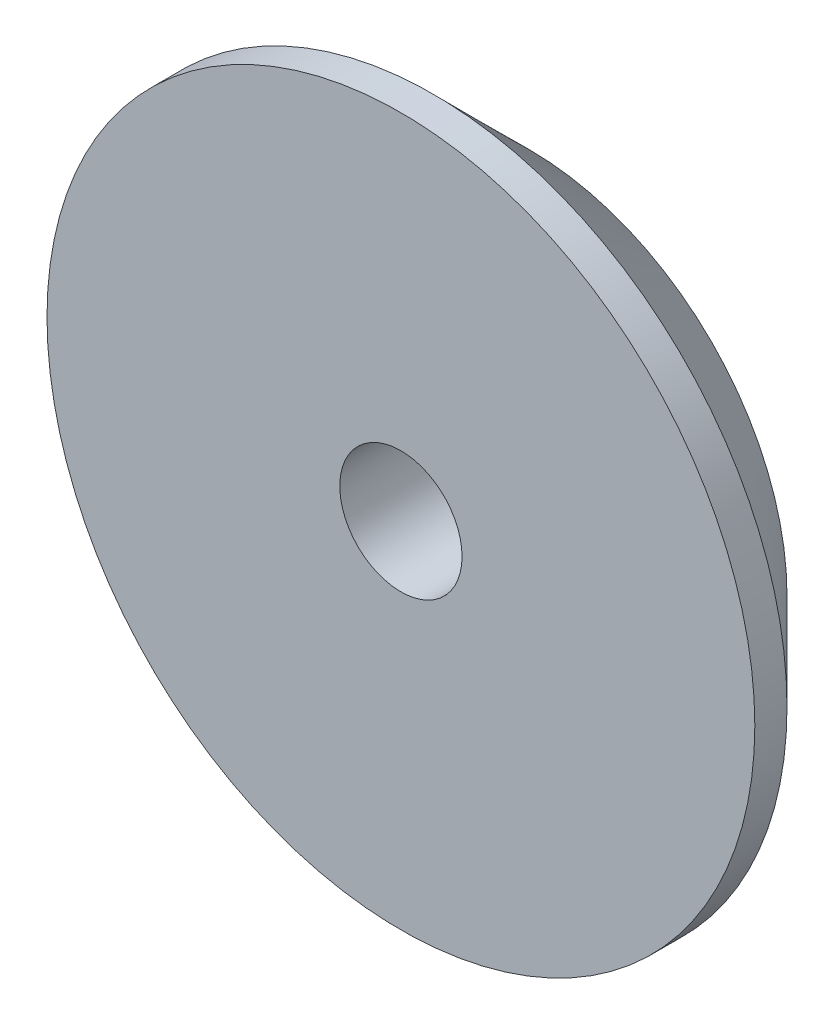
ISO-10303-21;
HEADER;
FILE_DESCRIPTION(('STEP AP214'),'2;1');
FILE_NAME('part.step','',(''),(''),'','','');
FILE_SCHEMA(('AUTOMOTIVE_DESIGN { 1 0 10303 214 1 1 1 1 }'));
ENDSEC;
DATA;
#1=APPLICATION_CONTEXT('core data for automotive mechanical design processes');
#2=APPLICATION_PROTOCOL_DEFINITION('international standard','automotive_design',2000,#1);
#3=PRODUCT_CONTEXT('',#1,'mechanical');
#4=PRODUCT('Part','Part','',(#3));
#5=PRODUCT_RELATED_PRODUCT_CATEGORY('part','',(#4));
#6=PRODUCT_DEFINITION_FORMATION('','',#4);
#7=PRODUCT_DEFINITION_CONTEXT('part definition',#1,'design');
#8=PRODUCT_DEFINITION('design','',#6,#7);
#9=PRODUCT_DEFINITION_SHAPE('','',#8);
#10=(LENGTH_UNIT() NAMED_UNIT(*) SI_UNIT(.MILLI.,.METRE.));
#11=(NAMED_UNIT(*) PLANE_ANGLE_UNIT() SI_UNIT($,.RADIAN.));
#12=(NAMED_UNIT(*) SI_UNIT($,.STERADIAN.) SOLID_ANGLE_UNIT());
#13=UNCERTAINTY_MEASURE_WITH_UNIT(LENGTH_MEASURE(1.E-05),#10,'distance_accuracy_value','');
#14=(GEOMETRIC_REPRESENTATION_CONTEXT(3) GLOBAL_UNCERTAINTY_ASSIGNED_CONTEXT((#13)) GLOBAL_UNIT_ASSIGNED_CONTEXT((#10,
#11,#12)) REPRESENTATION_CONTEXT('',''));
#15=CARTESIAN_POINT('',(0.,0.,0.));
#16=DIRECTION('',(0.,0.,1.));
#17=DIRECTION('',(1.,0.,0.));
#18=AXIS2_PLACEMENT_3D('',#15,#16,#17);
#19=CARTESIAN_POINT('',(0.,0.,2.));
#20=DIRECTION('',(0.,0.,1.));
#21=DIRECTION('',(1.,0.,0.));
#22=AXIS2_PLACEMENT_3D('',#19,#20,#21);
#23=PLANE('',#22);
#24=CARTESIAN_POINT('',(0.,0.,2.));
#25=DIRECTION('',(0.,0.,1.));
#26=DIRECTION('',(1.,0.,0.));
#27=AXIS2_PLACEMENT_3D('',#24,#25,#26);
#28=CIRCLE('',#27,5.5);
#29=CARTESIAN_POINT('',(5.5,0.,2.));
#30=VERTEX_POINT('',#29);
#31=EDGE_CURVE('E40',#30,#30,#28,.T.);
#32=ORIENTED_EDGE('',*,*,#31,.T.);
#33=EDGE_LOOP('',(#32));
#34=FACE_BOUND('',#33,.T.);
#35=CARTESIAN_POINT('',(0.,0.,2.));
#36=DIRECTION('',(0.,0.,1.));
#37=DIRECTION('',(1.,0.,0.));
#38=AXIS2_PLACEMENT_3D('',#35,#36,#37);
#39=CIRCLE('',#38,0.95);
#40=CARTESIAN_POINT('',(0.95,0.,2.));
#41=VERTEX_POINT('',#40);
#42=EDGE_CURVE('E44',#41,#41,#39,.T.);
#43=ORIENTED_EDGE('',*,*,#42,.F.);
#44=EDGE_LOOP('',(#43));
#45=FACE_BOUND('',#44,.T.);
#46=ADVANCED_FACE('F29',(#34,#45),#23,.T.);
#47=CARTESIAN_POINT('',(0.,0.,0.));
#48=DIRECTION('',(0.,0.,1.));
#49=DIRECTION('',(1.,0.,0.));
#50=AXIS2_PLACEMENT_3D('',#47,#48,#49);
#51=PLANE('',#50);
#52=CARTESIAN_POINT('',(0.,0.,0.));
#53=DIRECTION('',(0.,0.,1.));
#54=DIRECTION('',(1.,0.,0.));
#55=AXIS2_PLACEMENT_3D('',#52,#53,#54);
#56=CIRCLE('',#55,3.99999999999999);
#57=CARTESIAN_POINT('',(3.99999999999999,0.,0.));
#58=VERTEX_POINT('',#57);
#59=EDGE_CURVE('E10',#58,#58,#56,.F.);
#60=ORIENTED_EDGE('',*,*,#59,.T.);
#61=EDGE_LOOP('',(#60));
#62=FACE_BOUND('',#61,.T.);
#63=CARTESIAN_POINT('',(0.,0.,0.));
#64=DIRECTION('',(0.,0.,1.));
#65=DIRECTION('',(1.,0.,0.));
#66=AXIS2_PLACEMENT_3D('',#63,#64,#65);
#67=CIRCLE('',#66,0.95);
#68=CARTESIAN_POINT('',(0.95,0.,0.));
#69=VERTEX_POINT('',#68);
#70=EDGE_CURVE('E49',#69,#69,#67,.T.);
#71=ORIENTED_EDGE('',*,*,#70,.T.);
#72=EDGE_LOOP('',(#71));
#73=FACE_BOUND('',#72,.T.);
#74=ADVANCED_FACE('F53',(#62,#73),#51,.F.);
#75=CARTESIAN_POINT('',(0.,0.,2.));
#76=DIRECTION('',(0.,0.,-1.));
#77=DIRECTION('',(-1.,0.,0.));
#78=AXIS2_PLACEMENT_3D('',#75,#76,#77);
#79=CYLINDRICAL_SURFACE('',#78,5.5);
#80=CARTESIAN_POINT('',(0.,0.,1.5));
#81=DIRECTION('',(0.,0.,1.));
#82=DIRECTION('',(1.,0.,0.));
#83=AXIS2_PLACEMENT_3D('',#80,#81,#82);
#84=CIRCLE('',#83,5.5);
#85=CARTESIAN_POINT('',(5.5,0.,1.5));
#86=VERTEX_POINT('',#85);
#87=EDGE_CURVE('E36',#86,#86,#84,.T.);
#88=ORIENTED_EDGE('',*,*,#87,.T.);
#89=EDGE_LOOP('',(#88));
#90=FACE_BOUND('',#89,.T.);
#91=ORIENTED_EDGE('',*,*,#31,.F.);
#92=EDGE_LOOP('',(#91));
#93=FACE_BOUND('',#92,.T.);
#94=ADVANCED_FACE('F31',(#90,#93),#79,.T.);
#95=CARTESIAN_POINT('',(0.,0.,2.));
#96=DIRECTION('',(0.,0.,-1.));
#97=DIRECTION('',(-1.,0.,0.));
#98=AXIS2_PLACEMENT_3D('',#95,#96,#97);
#99=CYLINDRICAL_SURFACE('',#98,0.95);
#100=ORIENTED_EDGE('',*,*,#42,.T.);
#101=EDGE_LOOP('',(#100));
#102=FACE_BOUND('',#101,.T.);
#103=ORIENTED_EDGE('',*,*,#70,.F.);
#104=EDGE_LOOP('',(#103));
#105=FACE_BOUND('',#104,.T.);
#106=ADVANCED_FACE('F55',(#102,#105),#99,.F.);
#107=CARTESIAN_POINT('',(0.,0.,1.5));
#108=DIRECTION('',(0.,0.,1.));
#109=DIRECTION('',(1.,0.,0.));
#110=AXIS2_PLACEMENT_3D('',#107,#108,#109);
#111=CONICAL_SURFACE('',#110,5.5,0.785398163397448);
#112=ORIENTED_EDGE('',*,*,#59,.F.);
#113=EDGE_LOOP('',(#112));
#114=FACE_BOUND('',#113,.T.);
#115=ORIENTED_EDGE('',*,*,#87,.F.);
#116=EDGE_LOOP('',(#115));
#117=FACE_BOUND('',#116,.T.);
#118=ADVANCED_FACE('F57',(#114,#117),#111,.T.);
#119=CLOSED_SHELL('',(#46,#74,#94,#106,#118));
#120=MANIFOLD_SOLID_BREP('B2',#119);
#121=ADVANCED_BREP_SHAPE_REPRESENTATION('',(#18,#120),#14);
#122=SHAPE_DEFINITION_REPRESENTATION(#9,#121);
ENDSEC;
END-ISO-10303-21;
